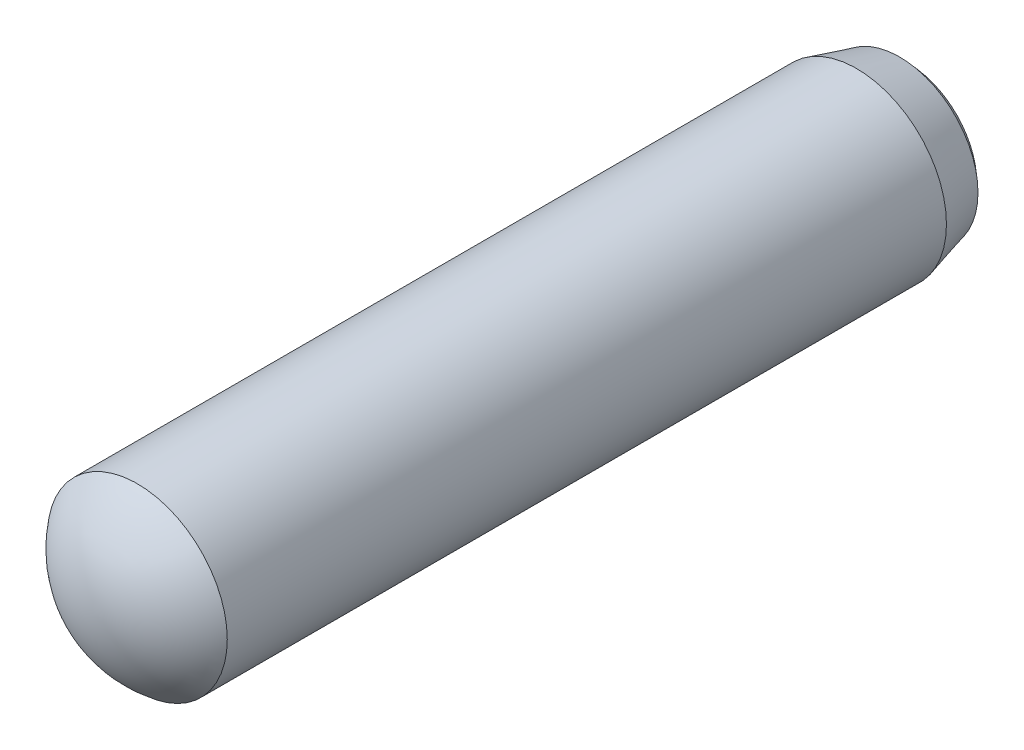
ISO-10303-21;
HEADER;
FILE_DESCRIPTION(('STEP AP214'),'2;1');
FILE_NAME('part.step','',(''),(''),'','','');
FILE_SCHEMA(('AUTOMOTIVE_DESIGN { 1 0 10303 214 1 1 1 1 }'));
ENDSEC;
DATA;
#1=APPLICATION_CONTEXT('core data for automotive mechanical design processes');
#2=APPLICATION_PROTOCOL_DEFINITION('international standard','automotive_design',2000,#1);
#3=PRODUCT_CONTEXT('',#1,'mechanical');
#4=PRODUCT('Part','Part','',(#3));
#5=PRODUCT_RELATED_PRODUCT_CATEGORY('part','',(#4));
#6=PRODUCT_DEFINITION_FORMATION('','',#4);
#7=PRODUCT_DEFINITION_CONTEXT('part definition',#1,'design');
#8=PRODUCT_DEFINITION('design','',#6,#7);
#9=PRODUCT_DEFINITION_SHAPE('','',#8);
#10=(LENGTH_UNIT() NAMED_UNIT(*) SI_UNIT(.MILLI.,.METRE.));
#11=(NAMED_UNIT(*) PLANE_ANGLE_UNIT() SI_UNIT($,.RADIAN.));
#12=(NAMED_UNIT(*) SI_UNIT($,.STERADIAN.) SOLID_ANGLE_UNIT());
#13=UNCERTAINTY_MEASURE_WITH_UNIT(LENGTH_MEASURE(1.E-05),#10,'distance_accuracy_value','');
#14=(GEOMETRIC_REPRESENTATION_CONTEXT(3) GLOBAL_UNCERTAINTY_ASSIGNED_CONTEXT((#13)) GLOBAL_UNIT_ASSIGNED_CONTEXT((#10,
#11,#12)) REPRESENTATION_CONTEXT('',''));
#15=CARTESIAN_POINT('',(0.,0.,0.));
#16=DIRECTION('',(0.,0.,1.));
#17=DIRECTION('',(1.,0.,0.));
#18=AXIS2_PLACEMENT_3D('',#15,#16,#17);
#19=CARTESIAN_POINT('',(0.,0.,12.5));
#20=DIRECTION('',(0.,0.,-1.));
#21=DIRECTION('',(-1.,0.,0.));
#22=AXIS2_PLACEMENT_3D('',#19,#20,#21);
#23=CYLINDRICAL_SURFACE('',#22,1.5);
#24=CARTESIAN_POINT('',(0.,0.,12.5));
#25=DIRECTION('',(0.,0.,1.));
#26=DIRECTION('',(1.,0.,0.));
#27=AXIS2_PLACEMENT_3D('',#24,#25,#26);
#28=CIRCLE('',#27,1.5);
#29=CARTESIAN_POINT('',(1.5,0.,12.5));
#30=VERTEX_POINT('',#29);
#31=EDGE_CURVE('E10',#30,#30,#28,.T.);
#32=ORIENTED_EDGE('',*,*,#31,.F.);
#33=EDGE_LOOP('',(#32));
#34=FACE_BOUND('',#33,.T.);
#35=CARTESIAN_POINT('',(0.,0.,0.5));
#36=DIRECTION('',(0.,0.,1.));
#37=DIRECTION('',(1.,0.,0.));
#38=AXIS2_PLACEMENT_3D('',#35,#36,#37);
#39=CIRCLE('',#38,1.5);
#40=CARTESIAN_POINT('',(1.5,0.,0.5));
#41=VERTEX_POINT('',#40);
#42=EDGE_CURVE('E32',#41,#41,#39,.T.);
#43=ORIENTED_EDGE('',*,*,#42,.T.);
#44=EDGE_LOOP('',(#43));
#45=FACE_BOUND('',#44,.T.);
#46=ADVANCED_FACE('F25',(#34,#45),#23,.T.);
#47=CARTESIAN_POINT('',(0.,0.,11.375));
#48=DIRECTION('',(0.,0.,1.));
#49=DIRECTION('',(1.,0.,0.));
#50=AXIS2_PLACEMENT_3D('',#47,#48,#49);
#51=SPHERICAL_SURFACE('',#50,1.875);
#52=ORIENTED_EDGE('',*,*,#31,.T.);
#53=EDGE_LOOP('',(#52));
#54=FACE_BOUND('',#53,.T.);
#55=ADVANCED_FACE('F50',(#54),#51,.T.);
#56=CARTESIAN_POINT('',(0.,0.,0.5));
#57=DIRECTION('',(0.,0.,1.));
#58=DIRECTION('',(1.,0.,0.));
#59=AXIS2_PLACEMENT_3D('',#56,#57,#58);
#60=CONICAL_SURFACE('',#59,1.5,0.261799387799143);
#61=CARTESIAN_POINT('',(0.,0.,-0.219070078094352));
#62=DIRECTION('',(0.,0.,1.));
#63=DIRECTION('',(1.,0.,0.));
#64=AXIS2_PLACEMENT_3D('',#61,#62,#63);
#65=CIRCLE('',#64,1.30732575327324);
#66=CARTESIAN_POINT('',(1.30732575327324,0.,-0.219070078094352));
#67=VERTEX_POINT('',#66);
#68=EDGE_CURVE('E36',#67,#67,#65,.T.);
#69=ORIENTED_EDGE('',*,*,#68,.T.);
#70=EDGE_LOOP('',(#69));
#71=FACE_BOUND('',#70,.T.);
#72=ORIENTED_EDGE('',*,*,#42,.F.);
#73=EDGE_LOOP('',(#72));
#74=FACE_BOUND('',#73,.T.);
#75=ADVANCED_FACE('F43',(#71,#74),#60,.T.);
#76=CARTESIAN_POINT('',(0.,0.,1.125));
#77=DIRECTION('',(0.,0.,1.));
#78=DIRECTION('',(1.,0.,0.));
#79=AXIS2_PLACEMENT_3D('',#76,#77,#78);
#80=SPHERICAL_SURFACE('',#79,1.875);
#81=ORIENTED_EDGE('',*,*,#68,.F.);
#82=EDGE_LOOP('',(#81));
#83=FACE_BOUND('',#82,.T.);
#84=ADVANCED_FACE('F27',(#83),#80,.T.);
#85=CLOSED_SHELL('',(#46,#55,#75,#84));
#86=MANIFOLD_SOLID_BREP('B2',#85);
#87=ADVANCED_BREP_SHAPE_REPRESENTATION('',(#18,#86),#14);
#88=SHAPE_DEFINITION_REPRESENTATION(#9,#87);
ENDSEC;
END-ISO-10303-21;
